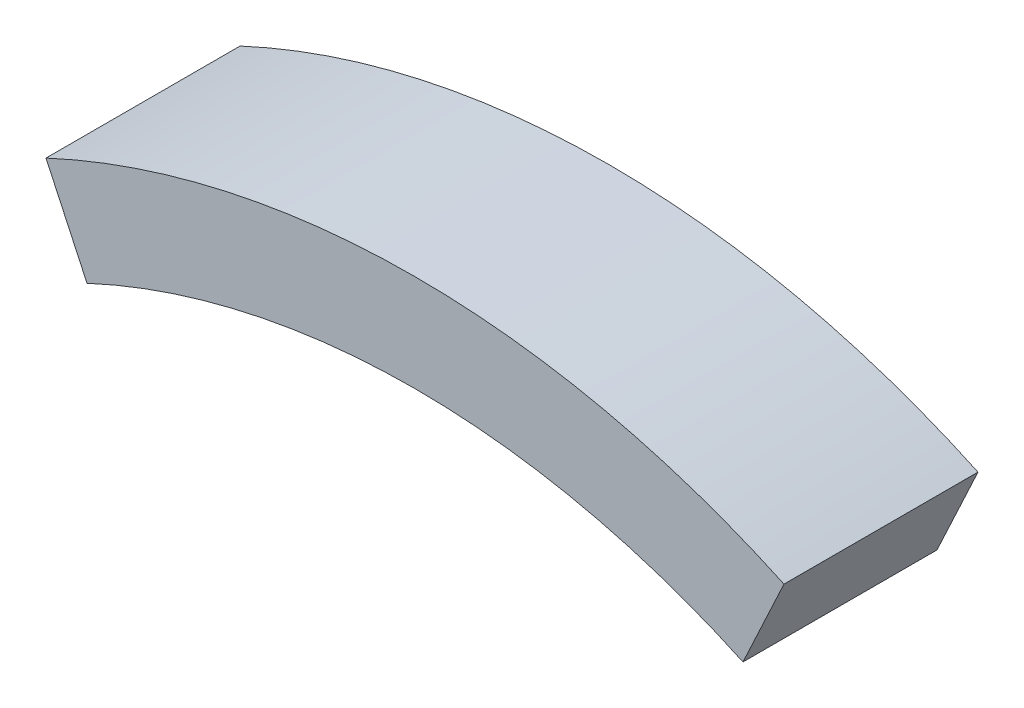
from build123d import *

# Parameters (mm, degrees)
EXTRUSION1_DEPTH = 10


with BuildPart() as part:
    # Esquisse1 → Extrusion1 (new body)
    with BuildSketch(Plane.XY):
        with BuildLine():
            Line((-19.017821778, 40.783850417), (-16.90473047, 36.252311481))
            ThreePointArc((-16.90473047, 36.252311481), (0, 40), (16.90473047, 36.252311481))
            Line((16.90473047, 36.252311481), (19.017821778, 40.783850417))
            ThreePointArc((19.017821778, 40.783850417), (0, 45), (-19.017821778, 40.783850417))
        make_face()
    extrude(amount=EXTRUSION1_DEPTH)


solid = part.part
